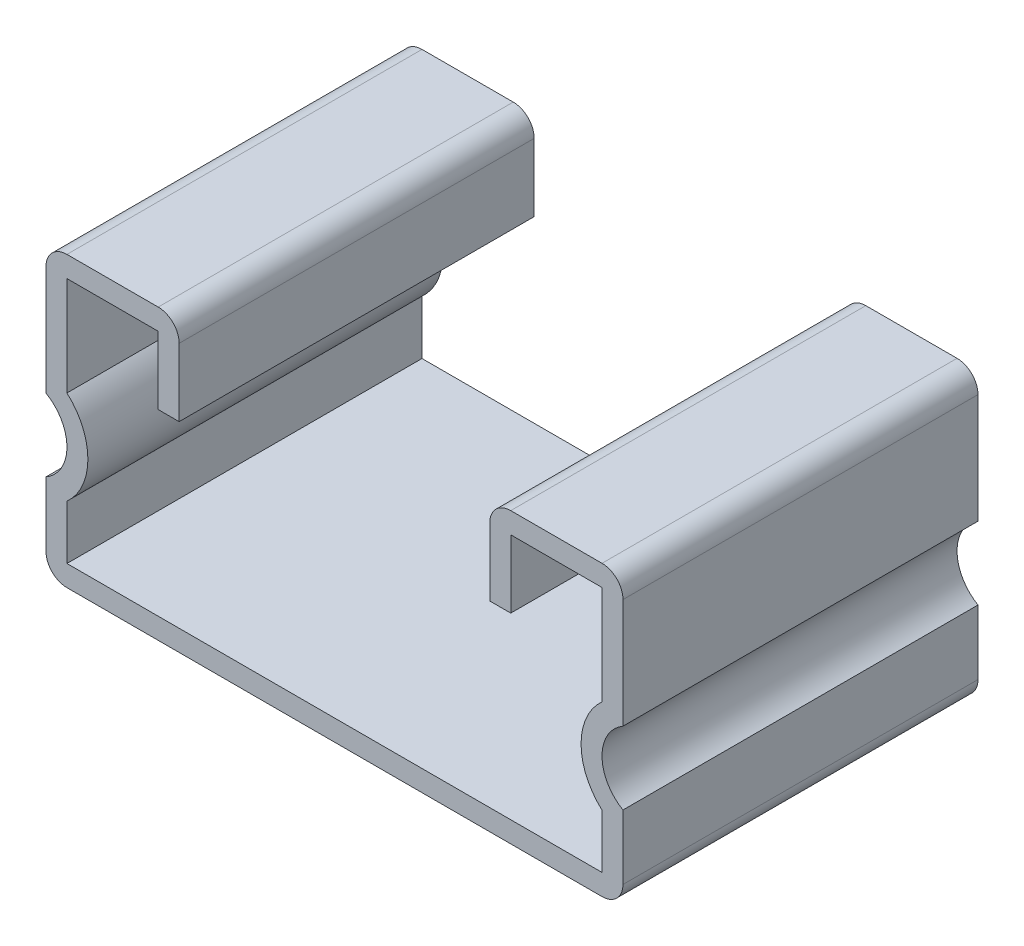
ISO-10303-21;
HEADER;
FILE_DESCRIPTION(('STEP AP214'),'2;1');
FILE_NAME('part.step','',(''),(''),'','','');
FILE_SCHEMA(('AUTOMOTIVE_DESIGN { 1 0 10303 214 1 1 1 1 }'));
ENDSEC;
DATA;
#1=APPLICATION_CONTEXT('core data for automotive mechanical design processes');
#2=APPLICATION_PROTOCOL_DEFINITION('international standard','automotive_design',2000,#1);
#3=PRODUCT_CONTEXT('',#1,'mechanical');
#4=PRODUCT('Part','Part','',(#3));
#5=PRODUCT_RELATED_PRODUCT_CATEGORY('part','',(#4));
#6=PRODUCT_DEFINITION_FORMATION('','',#4);
#7=PRODUCT_DEFINITION_CONTEXT('part definition',#1,'design');
#8=PRODUCT_DEFINITION('design','',#6,#7);
#9=PRODUCT_DEFINITION_SHAPE('','',#8);
#10=(LENGTH_UNIT() NAMED_UNIT(*) SI_UNIT(.MILLI.,.METRE.));
#11=(NAMED_UNIT(*) PLANE_ANGLE_UNIT() SI_UNIT($,.RADIAN.));
#12=(NAMED_UNIT(*) SI_UNIT($,.STERADIAN.) SOLID_ANGLE_UNIT());
#13=UNCERTAINTY_MEASURE_WITH_UNIT(LENGTH_MEASURE(1.E-05),#10,'distance_accuracy_value','');
#14=(GEOMETRIC_REPRESENTATION_CONTEXT(3) GLOBAL_UNCERTAINTY_ASSIGNED_CONTEXT((#13)) GLOBAL_UNIT_ASSIGNED_CONTEXT((#10,
#11,#12)) REPRESENTATION_CONTEXT('',''));
#15=CARTESIAN_POINT('',(0.,0.,0.));
#16=DIRECTION('',(0.,0.,1.));
#17=DIRECTION('',(1.,0.,0.));
#18=AXIS2_PLACEMENT_3D('',#15,#16,#17);
#19=CARTESIAN_POINT('',(-19.1389,10.4394,12.7));
#20=DIRECTION('',(-1.,0.,0.));
#21=DIRECTION('',(0.,0.,1.));
#22=AXIS2_PLACEMENT_3D('',#19,#20,#21);
#23=PLANE('',#22);
#24=DIRECTION('',(0.,1.,0.));
#25=VECTOR('',#24,1.);
#26=CARTESIAN_POINT('',(-19.1389,10.4394,-12.7));
#27=LINE('',#26,#25);
#28=CARTESIAN_POINT('',(-19.1389,3.35097147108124,-12.7));
#29=VERTEX_POINT('',#28);
#30=CARTESIAN_POINT('',(-19.1389,10.4394,-12.7));
#31=VERTEX_POINT('',#30);
#32=EDGE_CURVE('E261',#29,#31,#27,.T.);
#33=ORIENTED_EDGE('',*,*,#32,.T.);
#34=DIRECTION('',(0.,0.,-1.));
#35=VECTOR('',#34,1.);
#36=CARTESIAN_POINT('',(-19.1389,10.4394,12.7));
#37=LINE('',#36,#35);
#38=CARTESIAN_POINT('',(-19.1389,10.4394,12.7));
#39=VERTEX_POINT('',#38);
#40=EDGE_CURVE('E11',#39,#31,#37,.T.);
#41=ORIENTED_EDGE('',*,*,#40,.F.);
#42=DIRECTION('',(0.,1.,0.));
#43=VECTOR('',#42,1.);
#44=CARTESIAN_POINT('',(-19.1389,10.4394,12.7));
#45=LINE('',#44,#43);
#46=CARTESIAN_POINT('',(-19.1389,3.35097147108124,12.7));
#47=VERTEX_POINT('',#46);
#48=EDGE_CURVE('E319',#47,#39,#45,.T.);
#49=ORIENTED_EDGE('',*,*,#48,.F.);
#50=DIRECTION('',(0.,0.,-1.));
#51=VECTOR('',#50,1.);
#52=CARTESIAN_POINT('',(-19.1389,3.35097147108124,12.7));
#53=LINE('',#52,#51);
#54=EDGE_CURVE('E257',#47,#29,#53,.T.);
#55=ORIENTED_EDGE('',*,*,#54,.T.);
#56=EDGE_LOOP('',(#33,#41,#49,#55));
#57=FACE_BOUND('',#56,.T.);
#58=ADVANCED_FACE('F33',(#57),#23,.F.);
#59=CARTESIAN_POINT('',(-19.1389,10.4394,12.7));
#60=DIRECTION('',(0.,1.,0.));
#61=DIRECTION('',(-1.,0.,0.));
#62=AXIS2_PLACEMENT_3D('',#59,#60,#61);
#63=PLANE('',#62);
#64=DIRECTION('',(1.,0.,0.));
#65=VECTOR('',#64,1.);
#66=CARTESIAN_POINT('',(-19.1389,10.4394,-12.7));
#67=LINE('',#66,#65);
#68=CARTESIAN_POINT('',(-12.6111,10.4394,-12.7));
#69=VERTEX_POINT('',#68);
#70=EDGE_CURVE('E264',#31,#69,#67,.T.);
#71=ORIENTED_EDGE('',*,*,#70,.T.);
#72=DIRECTION('',(0.,0.,-1.));
#73=VECTOR('',#72,1.);
#74=CARTESIAN_POINT('',(-12.6111,10.4394,12.7));
#75=LINE('',#74,#73);
#76=CARTESIAN_POINT('',(-12.6111,10.4394,12.7));
#77=VERTEX_POINT('',#76);
#78=EDGE_CURVE('E41',#77,#69,#75,.T.);
#79=ORIENTED_EDGE('',*,*,#78,.F.);
#80=DIRECTION('',(1.,0.,0.));
#81=VECTOR('',#80,1.);
#82=CARTESIAN_POINT('',(-19.1389,10.4394,12.7));
#83=LINE('',#82,#81);
#84=EDGE_CURVE('E158',#39,#77,#83,.T.);
#85=ORIENTED_EDGE('',*,*,#84,.F.);
#86=ORIENTED_EDGE('',*,*,#40,.T.);
#87=EDGE_LOOP('',(#71,#79,#85,#86));
#88=FACE_BOUND('',#87,.T.);
#89=ADVANCED_FACE('F487',(#88),#63,.F.);
#90=CARTESIAN_POINT('',(-12.6111,10.4394,12.7));
#91=DIRECTION('',(1.,0.,0.));
#92=DIRECTION('',(0.,0.,-1.));
#93=AXIS2_PLACEMENT_3D('',#90,#91,#92);
#94=PLANE('',#93);
#95=DIRECTION('',(0.,-1.,0.));
#96=VECTOR('',#95,1.);
#97=CARTESIAN_POINT('',(-12.6111,10.4394,-12.7));
#98=LINE('',#97,#96);
#99=CARTESIAN_POINT('',(-12.6111,5.588,-12.7));
#100=VERTEX_POINT('',#99);
#101=EDGE_CURVE('E266',#69,#100,#98,.T.);
#102=ORIENTED_EDGE('',*,*,#101,.T.);
#103=DIRECTION('',(0.,0.,-1.));
#104=VECTOR('',#103,1.);
#105=CARTESIAN_POINT('',(-12.6111,5.588,12.7));
#106=LINE('',#105,#104);
#107=CARTESIAN_POINT('',(-12.6111,5.588,12.7));
#108=VERTEX_POINT('',#107);
#109=EDGE_CURVE('E392',#108,#100,#106,.T.);
#110=ORIENTED_EDGE('',*,*,#109,.F.);
#111=DIRECTION('',(0.,-1.,0.));
#112=VECTOR('',#111,1.);
#113=CARTESIAN_POINT('',(-12.6111,10.4394,12.7));
#114=LINE('',#113,#112);
#115=EDGE_CURVE('E400',#77,#108,#114,.T.);
#116=ORIENTED_EDGE('',*,*,#115,.F.);
#117=ORIENTED_EDGE('',*,*,#78,.T.);
#118=EDGE_LOOP('',(#102,#110,#116,#117));
#119=FACE_BOUND('',#118,.T.);
#120=ADVANCED_FACE('F398',(#119),#94,.F.);
#121=CARTESIAN_POINT('',(-12.6111,5.588,12.7));
#122=DIRECTION('',(0.,1.,0.));
#123=DIRECTION('',(0.,0.,1.));
#124=AXIS2_PLACEMENT_3D('',#121,#122,#123);
#125=PLANE('',#124);
#126=DIRECTION('',(1.,0.,0.));
#127=VECTOR('',#126,1.);
#128=CARTESIAN_POINT('',(-12.6111,5.588,-12.7));
#129=LINE('',#128,#127);
#130=CARTESIAN_POINT('',(-11.1125,5.588,-12.7));
#131=VERTEX_POINT('',#130);
#132=EDGE_CURVE('E268',#100,#131,#129,.T.);
#133=ORIENTED_EDGE('',*,*,#132,.T.);
#134=DIRECTION('',(0.,0.,-1.));
#135=VECTOR('',#134,1.);
#136=CARTESIAN_POINT('',(-11.1125,5.588,12.7));
#137=LINE('',#136,#135);
#138=CARTESIAN_POINT('',(-11.1125,5.588,12.7));
#139=VERTEX_POINT('',#138);
#140=EDGE_CURVE('E389',#139,#131,#137,.T.);
#141=ORIENTED_EDGE('',*,*,#140,.F.);
#142=DIRECTION('',(1.,0.,0.));
#143=VECTOR('',#142,1.);
#144=CARTESIAN_POINT('',(-12.6111,5.588,12.7));
#145=LINE('',#144,#143);
#146=EDGE_CURVE('E418',#108,#139,#145,.T.);
#147=ORIENTED_EDGE('',*,*,#146,.F.);
#148=ORIENTED_EDGE('',*,*,#109,.T.);
#149=EDGE_LOOP('',(#133,#141,#147,#148));
#150=FACE_BOUND('',#149,.T.);
#151=ADVANCED_FACE('F409',(#150),#125,.F.);
#152=CARTESIAN_POINT('',(-11.1125,10.4394,12.7));
#153=DIRECTION('',(-1.,0.,0.));
#154=DIRECTION('',(0.,-1.,0.));
#155=AXIS2_PLACEMENT_3D('',#152,#153,#154);
#156=PLANE('',#155);
#157=DIRECTION('',(0.,1.,0.));
#158=VECTOR('',#157,1.);
#159=CARTESIAN_POINT('',(-11.1125,10.4394,-12.7));
#160=LINE('',#159,#158);
#161=CARTESIAN_POINT('',(-11.1125,10.4394,-12.7));
#162=VERTEX_POINT('',#161);
#163=EDGE_CURVE('E270',#131,#162,#160,.T.);
#164=ORIENTED_EDGE('',*,*,#163,.T.);
#165=DIRECTION('',(0.,0.,-1.));
#166=VECTOR('',#165,1.);
#167=CARTESIAN_POINT('',(-11.1125,10.4394,12.7));
#168=LINE('',#167,#166);
#169=CARTESIAN_POINT('',(-11.1125,10.4394,12.7));
#170=VERTEX_POINT('',#169);
#171=EDGE_CURVE('E386',#170,#162,#168,.T.);
#172=ORIENTED_EDGE('',*,*,#171,.F.);
#173=DIRECTION('',(0.,1.,0.));
#174=VECTOR('',#173,1.);
#175=CARTESIAN_POINT('',(-11.1125,10.4394,12.7));
#176=LINE('',#175,#174);
#177=EDGE_CURVE('E415',#139,#170,#176,.T.);
#178=ORIENTED_EDGE('',*,*,#177,.F.);
#179=ORIENTED_EDGE('',*,*,#140,.T.);
#180=EDGE_LOOP('',(#164,#172,#178,#179));
#181=FACE_BOUND('',#180,.T.);
#182=ADVANCED_FACE('F413',(#181),#156,.F.);
#183=CARTESIAN_POINT('',(-12.6111,10.4394,12.7));
#184=DIRECTION('',(0.,0.,-1.));
#185=DIRECTION('',(-1.,0.,0.));
#186=AXIS2_PLACEMENT_3D('',#183,#184,#185);
#187=CYLINDRICAL_SURFACE('',#186,1.4986);
#188=CARTESIAN_POINT('',(-12.6111,10.4394,-12.7));
#189=DIRECTION('',(0.,0.,1.));
#190=DIRECTION('',(-1.,0.,0.));
#191=AXIS2_PLACEMENT_3D('',#188,#189,#190);
#192=CIRCLE('',#191,1.4986);
#193=CARTESIAN_POINT('',(-12.6111,11.938,-12.7));
#194=VERTEX_POINT('',#193);
#195=EDGE_CURVE('E272',#162,#194,#192,.T.);
#196=ORIENTED_EDGE('',*,*,#195,.T.);
#197=DIRECTION('',(0.,0.,-1.));
#198=VECTOR('',#197,1.);
#199=CARTESIAN_POINT('',(-12.6111,11.938,12.7));
#200=LINE('',#199,#198);
#201=CARTESIAN_POINT('',(-12.6111,11.938,12.7));
#202=VERTEX_POINT('',#201);
#203=EDGE_CURVE('E383',#202,#194,#200,.T.);
#204=ORIENTED_EDGE('',*,*,#203,.F.);
#205=CARTESIAN_POINT('',(-12.6111,10.4394,12.7));
#206=DIRECTION('',(0.,0.,1.));
#207=DIRECTION('',(-1.,0.,0.));
#208=AXIS2_PLACEMENT_3D('',#205,#206,#207);
#209=CIRCLE('',#208,1.4986);
#210=EDGE_CURVE('E417',#170,#202,#209,.T.);
#211=ORIENTED_EDGE('',*,*,#210,.F.);
#212=ORIENTED_EDGE('',*,*,#171,.T.);
#213=EDGE_LOOP('',(#196,#204,#211,#212));
#214=FACE_BOUND('',#213,.T.);
#215=ADVANCED_FACE('F500',(#214),#187,.T.);
#216=CARTESIAN_POINT('',(-19.1389,11.938,12.7));
#217=DIRECTION('',(0.,-1.,0.));
#218=DIRECTION('',(0.,0.,-1.));
#219=AXIS2_PLACEMENT_3D('',#216,#217,#218);
#220=PLANE('',#219);
#221=DIRECTION('',(-1.,0.,0.));
#222=VECTOR('',#221,1.);
#223=CARTESIAN_POINT('',(-19.1389,11.938,-12.7));
#224=LINE('',#223,#222);
#225=CARTESIAN_POINT('',(-19.1389,11.938,-12.7));
#226=VERTEX_POINT('',#225);
#227=EDGE_CURVE('E274',#194,#226,#224,.T.);
#228=ORIENTED_EDGE('',*,*,#227,.T.);
#229=DIRECTION('',(0.,0.,-1.));
#230=VECTOR('',#229,1.);
#231=CARTESIAN_POINT('',(-19.1389,11.938,12.7));
#232=LINE('',#231,#230);
#233=CARTESIAN_POINT('',(-19.1389,11.938,12.7));
#234=VERTEX_POINT('',#233);
#235=EDGE_CURVE('E380',#234,#226,#232,.T.);
#236=ORIENTED_EDGE('',*,*,#235,.F.);
#237=DIRECTION('',(-1.,0.,0.));
#238=VECTOR('',#237,1.);
#239=CARTESIAN_POINT('',(-19.1389,11.938,12.7));
#240=LINE('',#239,#238);
#241=EDGE_CURVE('E420',#202,#234,#240,.T.);
#242=ORIENTED_EDGE('',*,*,#241,.F.);
#243=ORIENTED_EDGE('',*,*,#203,.T.);
#244=EDGE_LOOP('',(#228,#236,#242,#243));
#245=FACE_BOUND('',#244,.T.);
#246=ADVANCED_FACE('F503',(#245),#220,.F.);
#247=CARTESIAN_POINT('',(-19.1389,10.4394,12.7));
#248=DIRECTION('',(0.,0.,-1.));
#249=DIRECTION('',(-1.,0.,0.));
#250=AXIS2_PLACEMENT_3D('',#247,#248,#249);
#251=CYLINDRICAL_SURFACE('',#250,1.49860000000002);
#252=CARTESIAN_POINT('',(-19.1389,10.4394,-12.7));
#253=DIRECTION('',(0.,0.,1.));
#254=DIRECTION('',(-1.,0.,0.));
#255=AXIS2_PLACEMENT_3D('',#252,#253,#254);
#256=CIRCLE('',#255,1.49860000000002);
#257=CARTESIAN_POINT('',(-20.6375,10.4394,-12.7));
#258=VERTEX_POINT('',#257);
#259=EDGE_CURVE('E276',#226,#258,#256,.T.);
#260=ORIENTED_EDGE('',*,*,#259,.T.);
#261=DIRECTION('',(0.,0.,-1.));
#262=VECTOR('',#261,1.);
#263=CARTESIAN_POINT('',(-20.6375,10.4394,12.7));
#264=LINE('',#263,#262);
#265=CARTESIAN_POINT('',(-20.6375,10.4394,12.7));
#266=VERTEX_POINT('',#265);
#267=EDGE_CURVE('E377',#266,#258,#264,.T.);
#268=ORIENTED_EDGE('',*,*,#267,.F.);
#269=CARTESIAN_POINT('',(-19.1389,10.4394,12.7));
#270=DIRECTION('',(0.,0.,1.));
#271=DIRECTION('',(-1.,0.,0.));
#272=AXIS2_PLACEMENT_3D('',#269,#270,#271);
#273=CIRCLE('',#272,1.49860000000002);
#274=EDGE_CURVE('E426',#234,#266,#273,.T.);
#275=ORIENTED_EDGE('',*,*,#274,.F.);
#276=ORIENTED_EDGE('',*,*,#235,.T.);
#277=EDGE_LOOP('',(#260,#268,#275,#276));
#278=FACE_BOUND('',#277,.T.);
#279=ADVANCED_FACE('F507',(#278),#251,.T.);
#280=CARTESIAN_POINT('',(-20.6375,10.4394,12.7));
#281=DIRECTION('',(1.,0.,0.));
#282=DIRECTION('',(0.,1.,0.));
#283=AXIS2_PLACEMENT_3D('',#280,#281,#282);
#284=PLANE('',#283);
#285=DIRECTION('',(0.,-1.,0.));
#286=VECTOR('',#285,1.);
#287=CARTESIAN_POINT('',(-20.6375,10.4394,-12.7));
#288=LINE('',#287,#286);
#289=CARTESIAN_POINT('',(-20.6375,2.59565134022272,-12.7));
#290=VERTEX_POINT('',#289);
#291=EDGE_CURVE('E278',#258,#290,#288,.T.);
#292=ORIENTED_EDGE('',*,*,#291,.T.);
#293=DIRECTION('',(0.,0.,-1.));
#294=VECTOR('',#293,1.);
#295=CARTESIAN_POINT('',(-20.6375,2.59565134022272,12.7));
#296=LINE('',#295,#294);
#297=CARTESIAN_POINT('',(-20.6375,2.59565134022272,12.7));
#298=VERTEX_POINT('',#297);
#299=EDGE_CURVE('E374',#298,#290,#296,.T.);
#300=ORIENTED_EDGE('',*,*,#299,.F.);
#301=DIRECTION('',(0.,-1.,0.));
#302=VECTOR('',#301,1.);
#303=CARTESIAN_POINT('',(-20.6375,10.4394,12.7));
#304=LINE('',#303,#302);
#305=EDGE_CURVE('E428',#266,#298,#304,.T.);
#306=ORIENTED_EDGE('',*,*,#305,.F.);
#307=ORIENTED_EDGE('',*,*,#267,.T.);
#308=EDGE_LOOP('',(#292,#300,#306,#307));
#309=FACE_BOUND('',#308,.T.);
#310=ADVANCED_FACE('F511',(#309),#284,.F.);
#311=CARTESIAN_POINT('',(-22.1361,0.,12.7));
#312=DIRECTION('',(0.,0.,-1.));
#313=DIRECTION('',(-1.,0.,0.));
#314=AXIS2_PLACEMENT_3D('',#311,#312,#313);
#315=CYLINDRICAL_SURFACE('',#314,2.9972);
#316=CARTESIAN_POINT('',(-22.1361,0.,-12.7));
#317=DIRECTION('',(0.,0.,-1.));
#318=DIRECTION('',(1.,0.,0.));
#319=AXIS2_PLACEMENT_3D('',#316,#317,#318);
#320=CIRCLE('',#319,2.9972);
#321=CARTESIAN_POINT('',(-20.6375,-2.59565134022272,-12.7));
#322=VERTEX_POINT('',#321);
#323=EDGE_CURVE('E280',#290,#322,#320,.T.);
#324=ORIENTED_EDGE('',*,*,#323,.T.);
#325=DIRECTION('',(0.,0.,-1.));
#326=VECTOR('',#325,1.);
#327=CARTESIAN_POINT('',(-20.6375,-2.59565134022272,12.7));
#328=LINE('',#327,#326);
#329=CARTESIAN_POINT('',(-20.6375,-2.59565134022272,12.7));
#330=VERTEX_POINT('',#329);
#331=EDGE_CURVE('E371',#330,#322,#328,.T.);
#332=ORIENTED_EDGE('',*,*,#331,.F.);
#333=CARTESIAN_POINT('',(-22.1361,0.,12.7));
#334=DIRECTION('',(0.,0.,-1.));
#335=DIRECTION('',(1.,0.,0.));
#336=AXIS2_PLACEMENT_3D('',#333,#334,#335);
#337=CIRCLE('',#336,2.9972);
#338=EDGE_CURVE('E430',#298,#330,#337,.T.);
#339=ORIENTED_EDGE('',*,*,#338,.F.);
#340=ORIENTED_EDGE('',*,*,#299,.T.);
#341=EDGE_LOOP('',(#324,#332,#339,#340));
#342=FACE_BOUND('',#341,.T.);
#343=ADVANCED_FACE('F515',(#342),#315,.F.);
#344=CARTESIAN_POINT('',(-20.6375,-2.59565134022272,12.7));
#345=DIRECTION('',(1.,0.,0.));
#346=DIRECTION('',(0.,1.,0.));
#347=AXIS2_PLACEMENT_3D('',#344,#345,#346);
#348=PLANE('',#347);
#349=DIRECTION('',(0.,-1.,0.));
#350=VECTOR('',#349,1.);
#351=CARTESIAN_POINT('',(-20.6375,-2.59565134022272,-12.7));
#352=LINE('',#351,#350);
#353=CARTESIAN_POINT('',(-20.6375,-7.2136,-12.7));
#354=VERTEX_POINT('',#353);
#355=EDGE_CURVE('E282',#322,#354,#352,.T.);
#356=ORIENTED_EDGE('',*,*,#355,.T.);
#357=DIRECTION('',(0.,0.,-1.));
#358=VECTOR('',#357,1.);
#359=CARTESIAN_POINT('',(-20.6375,-7.2136,12.7));
#360=LINE('',#359,#358);
#361=CARTESIAN_POINT('',(-20.6375,-7.2136,12.7));
#362=VERTEX_POINT('',#361);
#363=EDGE_CURVE('E368',#362,#354,#360,.T.);
#364=ORIENTED_EDGE('',*,*,#363,.F.);
#365=DIRECTION('',(0.,-1.,0.));
#366=VECTOR('',#365,1.);
#367=CARTESIAN_POINT('',(-20.6375,-2.59565134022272,12.7));
#368=LINE('',#367,#366);
#369=EDGE_CURVE('E432',#330,#362,#368,.T.);
#370=ORIENTED_EDGE('',*,*,#369,.F.);
#371=ORIENTED_EDGE('',*,*,#331,.T.);
#372=EDGE_LOOP('',(#356,#364,#370,#371));
#373=FACE_BOUND('',#372,.T.);
#374=ADVANCED_FACE('F519',(#373),#348,.F.);
#375=CARTESIAN_POINT('',(-19.1389,-7.2136,12.7));
#376=DIRECTION('',(0.,0.,-1.));
#377=DIRECTION('',(-1.,0.,0.));
#378=AXIS2_PLACEMENT_3D('',#375,#376,#377);
#379=CYLINDRICAL_SURFACE('',#378,1.4986);
#380=CARTESIAN_POINT('',(-19.1389,-7.2136,-12.7));
#381=DIRECTION('',(0.,0.,1.));
#382=DIRECTION('',(-1.,0.,0.));
#383=AXIS2_PLACEMENT_3D('',#380,#381,#382);
#384=CIRCLE('',#383,1.4986);
#385=CARTESIAN_POINT('',(-19.1389,-8.7122,-12.7));
#386=VERTEX_POINT('',#385);
#387=EDGE_CURVE('E284',#354,#386,#384,.T.);
#388=ORIENTED_EDGE('',*,*,#387,.T.);
#389=DIRECTION('',(0.,0.,-1.));
#390=VECTOR('',#389,1.);
#391=CARTESIAN_POINT('',(-19.1389,-8.7122,12.7));
#392=LINE('',#391,#390);
#393=CARTESIAN_POINT('',(-19.1389,-8.7122,12.7));
#394=VERTEX_POINT('',#393);
#395=EDGE_CURVE('E365',#394,#386,#392,.T.);
#396=ORIENTED_EDGE('',*,*,#395,.F.);
#397=CARTESIAN_POINT('',(-19.1389,-7.2136,12.7));
#398=DIRECTION('',(0.,0.,1.));
#399=DIRECTION('',(-1.,0.,0.));
#400=AXIS2_PLACEMENT_3D('',#397,#398,#399);
#401=CIRCLE('',#400,1.4986);
#402=EDGE_CURVE('E434',#362,#394,#401,.T.);
#403=ORIENTED_EDGE('',*,*,#402,.F.);
#404=ORIENTED_EDGE('',*,*,#363,.T.);
#405=EDGE_LOOP('',(#388,#396,#403,#404));
#406=FACE_BOUND('',#405,.T.);
#407=ADVANCED_FACE('F523',(#406),#379,.T.);
#408=CARTESIAN_POINT('',(-19.1389,-8.7122,12.7));
#409=DIRECTION('',(0.,1.,0.));
#410=DIRECTION('',(0.,0.,1.));
#411=AXIS2_PLACEMENT_3D('',#408,#409,#410);
#412=PLANE('',#411);
#413=DIRECTION('',(1.,0.,0.));
#414=VECTOR('',#413,1.);
#415=CARTESIAN_POINT('',(-19.1389,-8.7122,-12.7));
#416=LINE('',#415,#414);
#417=CARTESIAN_POINT('',(19.1389,-8.7122,-12.7));
#418=VERTEX_POINT('',#417);
#419=EDGE_CURVE('E286',#386,#418,#416,.T.);
#420=ORIENTED_EDGE('',*,*,#419,.T.);
#421=DIRECTION('',(0.,0.,-1.));
#422=VECTOR('',#421,1.);
#423=CARTESIAN_POINT('',(19.1389,-8.7122,12.7));
#424=LINE('',#423,#422);
#425=CARTESIAN_POINT('',(19.1389,-8.7122,12.7));
#426=VERTEX_POINT('',#425);
#427=EDGE_CURVE('E362',#426,#418,#424,.T.);
#428=ORIENTED_EDGE('',*,*,#427,.F.);
#429=DIRECTION('',(1.,0.,0.));
#430=VECTOR('',#429,1.);
#431=CARTESIAN_POINT('',(-19.1389,-8.7122,12.7));
#432=LINE('',#431,#430);
#433=EDGE_CURVE('E436',#394,#426,#432,.T.);
#434=ORIENTED_EDGE('',*,*,#433,.F.);
#435=ORIENTED_EDGE('',*,*,#395,.T.);
#436=EDGE_LOOP('',(#420,#428,#434,#435));
#437=FACE_BOUND('',#436,.T.);
#438=ADVANCED_FACE('F527',(#437),#412,.F.);
#439=CARTESIAN_POINT('',(19.1389,-7.2136,12.7));
#440=DIRECTION('',(0.,0.,-1.));
#441=DIRECTION('',(-1.,0.,0.));
#442=AXIS2_PLACEMENT_3D('',#439,#440,#441);
#443=CYLINDRICAL_SURFACE('',#442,1.4986);
#444=CARTESIAN_POINT('',(19.1389,-7.2136,-12.7));
#445=DIRECTION('',(0.,0.,1.));
#446=DIRECTION('',(-1.,0.,0.));
#447=AXIS2_PLACEMENT_3D('',#444,#445,#446);
#448=CIRCLE('',#447,1.4986);
#449=CARTESIAN_POINT('',(20.6375,-7.2136,-12.7));
#450=VERTEX_POINT('',#449);
#451=EDGE_CURVE('E288',#418,#450,#448,.T.);
#452=ORIENTED_EDGE('',*,*,#451,.T.);
#453=DIRECTION('',(0.,0.,-1.));
#454=VECTOR('',#453,1.);
#455=CARTESIAN_POINT('',(20.6375,-7.2136,12.7));
#456=LINE('',#455,#454);
#457=CARTESIAN_POINT('',(20.6375,-7.2136,12.7));
#458=VERTEX_POINT('',#457);
#459=EDGE_CURVE('E359',#458,#450,#456,.T.);
#460=ORIENTED_EDGE('',*,*,#459,.F.);
#461=CARTESIAN_POINT('',(19.1389,-7.2136,12.7));
#462=DIRECTION('',(0.,0.,1.));
#463=DIRECTION('',(-1.,0.,0.));
#464=AXIS2_PLACEMENT_3D('',#461,#462,#463);
#465=CIRCLE('',#464,1.4986);
#466=EDGE_CURVE('E438',#426,#458,#465,.T.);
#467=ORIENTED_EDGE('',*,*,#466,.F.);
#468=ORIENTED_EDGE('',*,*,#427,.T.);
#469=EDGE_LOOP('',(#452,#460,#467,#468));
#470=FACE_BOUND('',#469,.T.);
#471=ADVANCED_FACE('F531',(#470),#443,.T.);
#472=CARTESIAN_POINT('',(20.6375,-7.2136,12.7));
#473=DIRECTION('',(-1.,0.,0.));
#474=DIRECTION('',(0.,0.,1.));
#475=AXIS2_PLACEMENT_3D('',#472,#473,#474);
#476=PLANE('',#475);
#477=DIRECTION('',(0.,1.,0.));
#478=VECTOR('',#477,1.);
#479=CARTESIAN_POINT('',(20.6375,-7.2136,-12.7));
#480=LINE('',#479,#478);
#481=CARTESIAN_POINT('',(20.6375,-2.59565134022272,-12.7));
#482=VERTEX_POINT('',#481);
#483=EDGE_CURVE('E290',#450,#482,#480,.T.);
#484=ORIENTED_EDGE('',*,*,#483,.T.);
#485=DIRECTION('',(0.,0.,-1.));
#486=VECTOR('',#485,1.);
#487=CARTESIAN_POINT('',(20.6375,-2.59565134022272,12.7));
#488=LINE('',#487,#486);
#489=CARTESIAN_POINT('',(20.6375,-2.59565134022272,12.7));
#490=VERTEX_POINT('',#489);
#491=EDGE_CURVE('E356',#490,#482,#488,.T.);
#492=ORIENTED_EDGE('',*,*,#491,.F.);
#493=DIRECTION('',(0.,1.,0.));
#494=VECTOR('',#493,1.);
#495=CARTESIAN_POINT('',(20.6375,-7.2136,12.7));
#496=LINE('',#495,#494);
#497=EDGE_CURVE('E440',#458,#490,#496,.T.);
#498=ORIENTED_EDGE('',*,*,#497,.F.);
#499=ORIENTED_EDGE('',*,*,#459,.T.);
#500=EDGE_LOOP('',(#484,#492,#498,#499));
#501=FACE_BOUND('',#500,.T.);
#502=ADVANCED_FACE('F535',(#501),#476,.F.);
#503=CARTESIAN_POINT('',(22.1361,0.,12.7));
#504=DIRECTION('',(0.,0.,-1.));
#505=DIRECTION('',(-1.,0.,0.));
#506=AXIS2_PLACEMENT_3D('',#503,#504,#505);
#507=CYLINDRICAL_SURFACE('',#506,2.9972);
#508=CARTESIAN_POINT('',(22.1361,0.,-12.7));
#509=DIRECTION('',(0.,0.,-1.));
#510=DIRECTION('',(1.,0.,0.));
#511=AXIS2_PLACEMENT_3D('',#508,#509,#510);
#512=CIRCLE('',#511,2.9972);
#513=CARTESIAN_POINT('',(20.6375,2.59565134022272,-12.7));
#514=VERTEX_POINT('',#513);
#515=EDGE_CURVE('E292',#482,#514,#512,.T.);
#516=ORIENTED_EDGE('',*,*,#515,.T.);
#517=DIRECTION('',(0.,0.,-1.));
#518=VECTOR('',#517,1.);
#519=CARTESIAN_POINT('',(20.6375,2.59565134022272,12.7));
#520=LINE('',#519,#518);
#521=CARTESIAN_POINT('',(20.6375,2.59565134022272,12.7));
#522=VERTEX_POINT('',#521);
#523=EDGE_CURVE('E353',#522,#514,#520,.T.);
#524=ORIENTED_EDGE('',*,*,#523,.F.);
#525=CARTESIAN_POINT('',(22.1361,0.,12.7));
#526=DIRECTION('',(0.,0.,-1.));
#527=DIRECTION('',(1.,0.,0.));
#528=AXIS2_PLACEMENT_3D('',#525,#526,#527);
#529=CIRCLE('',#528,2.9972);
#530=EDGE_CURVE('E442',#490,#522,#529,.T.);
#531=ORIENTED_EDGE('',*,*,#530,.F.);
#532=ORIENTED_EDGE('',*,*,#491,.T.);
#533=EDGE_LOOP('',(#516,#524,#531,#532));
#534=FACE_BOUND('',#533,.T.);
#535=ADVANCED_FACE('F539',(#534),#507,.F.);
#536=CARTESIAN_POINT('',(20.6375,2.59565134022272,12.7));
#537=DIRECTION('',(-1.,0.,0.));
#538=DIRECTION('',(0.,-1.,0.));
#539=AXIS2_PLACEMENT_3D('',#536,#537,#538);
#540=PLANE('',#539);
#541=DIRECTION('',(0.,1.,0.));
#542=VECTOR('',#541,1.);
#543=CARTESIAN_POINT('',(20.6375,2.59565134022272,-12.7));
#544=LINE('',#543,#542);
#545=CARTESIAN_POINT('',(20.6375,10.4394,-12.7));
#546=VERTEX_POINT('',#545);
#547=EDGE_CURVE('E294',#514,#546,#544,.T.);
#548=ORIENTED_EDGE('',*,*,#547,.T.);
#549=DIRECTION('',(0.,0.,-1.));
#550=VECTOR('',#549,1.);
#551=CARTESIAN_POINT('',(20.6375,10.4394,12.7));
#552=LINE('',#551,#550);
#553=CARTESIAN_POINT('',(20.6375,10.4394,12.7));
#554=VERTEX_POINT('',#553);
#555=EDGE_CURVE('E350',#554,#546,#552,.T.);
#556=ORIENTED_EDGE('',*,*,#555,.F.);
#557=DIRECTION('',(0.,1.,0.));
#558=VECTOR('',#557,1.);
#559=CARTESIAN_POINT('',(20.6375,2.59565134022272,12.7));
#560=LINE('',#559,#558);
#561=EDGE_CURVE('E444',#522,#554,#560,.T.);
#562=ORIENTED_EDGE('',*,*,#561,.F.);
#563=ORIENTED_EDGE('',*,*,#523,.T.);
#564=EDGE_LOOP('',(#548,#556,#562,#563));
#565=FACE_BOUND('',#564,.T.);
#566=ADVANCED_FACE('F543',(#565),#540,.F.);
#567=CARTESIAN_POINT('',(19.1389,10.4394,12.7));
#568=DIRECTION('',(0.,0.,-1.));
#569=DIRECTION('',(-1.,0.,0.));
#570=AXIS2_PLACEMENT_3D('',#567,#568,#569);
#571=CYLINDRICAL_SURFACE('',#570,1.4986);
#572=CARTESIAN_POINT('',(19.1389,10.4394,-12.7));
#573=DIRECTION('',(0.,0.,1.));
#574=DIRECTION('',(-1.,0.,0.));
#575=AXIS2_PLACEMENT_3D('',#572,#573,#574);
#576=CIRCLE('',#575,1.4986);
#577=CARTESIAN_POINT('',(19.1389,11.938,-12.7));
#578=VERTEX_POINT('',#577);
#579=EDGE_CURVE('E296',#546,#578,#576,.T.);
#580=ORIENTED_EDGE('',*,*,#579,.T.);
#581=DIRECTION('',(0.,0.,-1.));
#582=VECTOR('',#581,1.);
#583=CARTESIAN_POINT('',(19.1389,11.938,12.7));
#584=LINE('',#583,#582);
#585=CARTESIAN_POINT('',(19.1389,11.938,12.7));
#586=VERTEX_POINT('',#585);
#587=EDGE_CURVE('E347',#586,#578,#584,.T.);
#588=ORIENTED_EDGE('',*,*,#587,.F.);
#589=CARTESIAN_POINT('',(19.1389,10.4394,12.7));
#590=DIRECTION('',(0.,0.,1.));
#591=DIRECTION('',(-1.,0.,0.));
#592=AXIS2_PLACEMENT_3D('',#589,#590,#591);
#593=CIRCLE('',#592,1.4986);
#594=EDGE_CURVE('E446',#554,#586,#593,.T.);
#595=ORIENTED_EDGE('',*,*,#594,.F.);
#596=ORIENTED_EDGE('',*,*,#555,.T.);
#597=EDGE_LOOP('',(#580,#588,#595,#596));
#598=FACE_BOUND('',#597,.T.);
#599=ADVANCED_FACE('F547',(#598),#571,.T.);
#600=CARTESIAN_POINT('',(19.1389,11.938,12.7));
#601=DIRECTION('',(0.,-1.,0.));
#602=DIRECTION('',(1.,0.,0.));
#603=AXIS2_PLACEMENT_3D('',#600,#601,#602);
#604=PLANE('',#603);
#605=DIRECTION('',(-1.,0.,0.));
#606=VECTOR('',#605,1.);
#607=CARTESIAN_POINT('',(19.1389,11.938,-12.7));
#608=LINE('',#607,#606);
#609=CARTESIAN_POINT('',(12.6111,11.938,-12.7));
#610=VERTEX_POINT('',#609);
#611=EDGE_CURVE('E298',#578,#610,#608,.T.);
#612=ORIENTED_EDGE('',*,*,#611,.T.);
#613=DIRECTION('',(0.,0.,-1.));
#614=VECTOR('',#613,1.);
#615=CARTESIAN_POINT('',(12.6111,11.938,12.7));
#616=LINE('',#615,#614);
#617=CARTESIAN_POINT('',(12.6111,11.938,12.7));
#618=VERTEX_POINT('',#617);
#619=EDGE_CURVE('E344',#618,#610,#616,.T.);
#620=ORIENTED_EDGE('',*,*,#619,.F.);
#621=DIRECTION('',(-1.,0.,0.));
#622=VECTOR('',#621,1.);
#623=CARTESIAN_POINT('',(19.1389,11.938,12.7));
#624=LINE('',#623,#622);
#625=EDGE_CURVE('E448',#586,#618,#624,.T.);
#626=ORIENTED_EDGE('',*,*,#625,.F.);
#627=ORIENTED_EDGE('',*,*,#587,.T.);
#628=EDGE_LOOP('',(#612,#620,#626,#627));
#629=FACE_BOUND('',#628,.T.);
#630=ADVANCED_FACE('F551',(#629),#604,.F.);
#631=CARTESIAN_POINT('',(12.6111,10.4394,12.7));
#632=DIRECTION('',(0.,0.,-1.));
#633=DIRECTION('',(-1.,0.,0.));
#634=AXIS2_PLACEMENT_3D('',#631,#632,#633);
#635=CYLINDRICAL_SURFACE('',#634,1.4986);
#636=CARTESIAN_POINT('',(12.6111,10.4394,-12.7));
#637=DIRECTION('',(0.,0.,1.));
#638=DIRECTION('',(-1.,0.,0.));
#639=AXIS2_PLACEMENT_3D('',#636,#637,#638);
#640=CIRCLE('',#639,1.4986);
#641=CARTESIAN_POINT('',(11.1125,10.4394,-12.7));
#642=VERTEX_POINT('',#641);
#643=EDGE_CURVE('E300',#610,#642,#640,.T.);
#644=ORIENTED_EDGE('',*,*,#643,.T.);
#645=DIRECTION('',(0.,0.,-1.));
#646=VECTOR('',#645,1.);
#647=CARTESIAN_POINT('',(11.1125,10.4394,12.7));
#648=LINE('',#647,#646);
#649=CARTESIAN_POINT('',(11.1125,10.4394,12.7));
#650=VERTEX_POINT('',#649);
#651=EDGE_CURVE('E341',#650,#642,#648,.T.);
#652=ORIENTED_EDGE('',*,*,#651,.F.);
#653=CARTESIAN_POINT('',(12.6111,10.4394,12.7));
#654=DIRECTION('',(0.,0.,1.));
#655=DIRECTION('',(-1.,0.,0.));
#656=AXIS2_PLACEMENT_3D('',#653,#654,#655);
#657=CIRCLE('',#656,1.4986);
#658=EDGE_CURVE('E450',#618,#650,#657,.T.);
#659=ORIENTED_EDGE('',*,*,#658,.F.);
#660=ORIENTED_EDGE('',*,*,#619,.T.);
#661=EDGE_LOOP('',(#644,#652,#659,#660));
#662=FACE_BOUND('',#661,.T.);
#663=ADVANCED_FACE('F555',(#662),#635,.T.);
#664=CARTESIAN_POINT('',(11.1125,10.4394,12.7));
#665=DIRECTION('',(1.,0.,0.));
#666=DIRECTION('',(0.,0.,-1.));
#667=AXIS2_PLACEMENT_3D('',#664,#665,#666);
#668=PLANE('',#667);
#669=DIRECTION('',(0.,-1.,0.));
#670=VECTOR('',#669,1.);
#671=CARTESIAN_POINT('',(11.1125,10.4394,-12.7));
#672=LINE('',#671,#670);
#673=CARTESIAN_POINT('',(11.1125,5.588,-12.7));
#674=VERTEX_POINT('',#673);
#675=EDGE_CURVE('E302',#642,#674,#672,.T.);
#676=ORIENTED_EDGE('',*,*,#675,.T.);
#677=DIRECTION('',(0.,0.,-1.));
#678=VECTOR('',#677,1.);
#679=CARTESIAN_POINT('',(11.1125,5.588,12.7));
#680=LINE('',#679,#678);
#681=CARTESIAN_POINT('',(11.1125,5.588,12.7));
#682=VERTEX_POINT('',#681);
#683=EDGE_CURVE('E338',#682,#674,#680,.T.);
#684=ORIENTED_EDGE('',*,*,#683,.F.);
#685=DIRECTION('',(0.,-1.,0.));
#686=VECTOR('',#685,1.);
#687=CARTESIAN_POINT('',(11.1125,10.4394,12.7));
#688=LINE('',#687,#686);
#689=EDGE_CURVE('E452',#650,#682,#688,.T.);
#690=ORIENTED_EDGE('',*,*,#689,.F.);
#691=ORIENTED_EDGE('',*,*,#651,.T.);
#692=EDGE_LOOP('',(#676,#684,#690,#691));
#693=FACE_BOUND('',#692,.T.);
#694=ADVANCED_FACE('F559',(#693),#668,.F.);
#695=CARTESIAN_POINT('',(11.1125,5.588,12.7));
#696=DIRECTION('',(0.,1.,0.));
#697=DIRECTION('',(-1.,0.,0.));
#698=AXIS2_PLACEMENT_3D('',#695,#696,#697);
#699=PLANE('',#698);
#700=DIRECTION('',(1.,0.,0.));
#701=VECTOR('',#700,1.);
#702=CARTESIAN_POINT('',(11.1125,5.588,-12.7));
#703=LINE('',#702,#701);
#704=CARTESIAN_POINT('',(12.6111,5.588,-12.7));
#705=VERTEX_POINT('',#704);
#706=EDGE_CURVE('E304',#674,#705,#703,.T.);
#707=ORIENTED_EDGE('',*,*,#706,.T.);
#708=DIRECTION('',(0.,0.,-1.));
#709=VECTOR('',#708,1.);
#710=CARTESIAN_POINT('',(12.6111,5.588,12.7));
#711=LINE('',#710,#709);
#712=CARTESIAN_POINT('',(12.6111,5.588,12.7));
#713=VERTEX_POINT('',#712);
#714=EDGE_CURVE('E335',#713,#705,#711,.T.);
#715=ORIENTED_EDGE('',*,*,#714,.F.);
#716=DIRECTION('',(1.,0.,0.));
#717=VECTOR('',#716,1.);
#718=CARTESIAN_POINT('',(11.1125,5.588,12.7));
#719=LINE('',#718,#717);
#720=EDGE_CURVE('E454',#682,#713,#719,.T.);
#721=ORIENTED_EDGE('',*,*,#720,.F.);
#722=ORIENTED_EDGE('',*,*,#683,.T.);
#723=EDGE_LOOP('',(#707,#715,#721,#722));
#724=FACE_BOUND('',#723,.T.);
#725=ADVANCED_FACE('F563',(#724),#699,.F.);
#726=CARTESIAN_POINT('',(12.6111,10.4394,12.7));
#727=DIRECTION('',(-1.,0.,0.));
#728=DIRECTION('',(0.,0.,1.));
#729=AXIS2_PLACEMENT_3D('',#726,#727,#728);
#730=PLANE('',#729);
#731=DIRECTION('',(0.,1.,0.));
#732=VECTOR('',#731,1.);
#733=CARTESIAN_POINT('',(12.6111,10.4394,-12.7));
#734=LINE('',#733,#732);
#735=CARTESIAN_POINT('',(12.6111,10.4394,-12.7));
#736=VERTEX_POINT('',#735);
#737=EDGE_CURVE('E306',#705,#736,#734,.T.);
#738=ORIENTED_EDGE('',*,*,#737,.T.);
#739=DIRECTION('',(0.,0.,-1.));
#740=VECTOR('',#739,1.);
#741=CARTESIAN_POINT('',(12.6111,10.4394,12.7));
#742=LINE('',#741,#740);
#743=CARTESIAN_POINT('',(12.6111,10.4394,12.7));
#744=VERTEX_POINT('',#743);
#745=EDGE_CURVE('E332',#744,#736,#742,.T.);
#746=ORIENTED_EDGE('',*,*,#745,.F.);
#747=DIRECTION('',(0.,1.,0.));
#748=VECTOR('',#747,1.);
#749=CARTESIAN_POINT('',(12.6111,10.4394,12.7));
#750=LINE('',#749,#748);
#751=EDGE_CURVE('E456',#713,#744,#750,.T.);
#752=ORIENTED_EDGE('',*,*,#751,.F.);
#753=ORIENTED_EDGE('',*,*,#714,.T.);
#754=EDGE_LOOP('',(#738,#746,#752,#753));
#755=FACE_BOUND('',#754,.T.);
#756=ADVANCED_FACE('F567',(#755),#730,.F.);
#757=CARTESIAN_POINT('',(19.1389,10.4394,12.7));
#758=DIRECTION('',(0.,1.,0.));
#759=DIRECTION('',(-1.,0.,0.));
#760=AXIS2_PLACEMENT_3D('',#757,#758,#759);
#761=PLANE('',#760);
#762=DIRECTION('',(1.,0.,0.));
#763=VECTOR('',#762,1.);
#764=CARTESIAN_POINT('',(19.1389,10.4394,-12.7));
#765=LINE('',#764,#763);
#766=CARTESIAN_POINT('',(19.1389,10.4394,-12.7));
#767=VERTEX_POINT('',#766);
#768=EDGE_CURVE('E308',#736,#767,#765,.T.);
#769=ORIENTED_EDGE('',*,*,#768,.T.);
#770=DIRECTION('',(0.,0.,-1.));
#771=VECTOR('',#770,1.);
#772=CARTESIAN_POINT('',(19.1389,10.4394,12.7));
#773=LINE('',#772,#771);
#774=CARTESIAN_POINT('',(19.1389,10.4394,12.7));
#775=VERTEX_POINT('',#774);
#776=EDGE_CURVE('E329',#775,#767,#773,.T.);
#777=ORIENTED_EDGE('',*,*,#776,.F.);
#778=DIRECTION('',(1.,0.,0.));
#779=VECTOR('',#778,1.);
#780=CARTESIAN_POINT('',(19.1389,10.4394,12.7));
#781=LINE('',#780,#779);
#782=EDGE_CURVE('E458',#744,#775,#781,.T.);
#783=ORIENTED_EDGE('',*,*,#782,.F.);
#784=ORIENTED_EDGE('',*,*,#745,.T.);
#785=EDGE_LOOP('',(#769,#777,#783,#784));
#786=FACE_BOUND('',#785,.T.);
#787=ADVANCED_FACE('F571',(#786),#761,.F.);
#788=CARTESIAN_POINT('',(19.1389,3.35097147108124,12.7));
#789=DIRECTION('',(1.,0.,0.));
#790=DIRECTION('',(0.,1.,0.));
#791=AXIS2_PLACEMENT_3D('',#788,#789,#790);
#792=PLANE('',#791);
#793=DIRECTION('',(0.,-1.,0.));
#794=VECTOR('',#793,1.);
#795=CARTESIAN_POINT('',(19.1389,3.35097147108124,-12.7));
#796=LINE('',#795,#794);
#797=CARTESIAN_POINT('',(19.1389,3.35097147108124,-12.7));
#798=VERTEX_POINT('',#797);
#799=EDGE_CURVE('E310',#767,#798,#796,.T.);
#800=ORIENTED_EDGE('',*,*,#799,.T.);
#801=DIRECTION('',(0.,0.,-1.));
#802=VECTOR('',#801,1.);
#803=CARTESIAN_POINT('',(19.1389,3.35097147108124,12.7));
#804=LINE('',#803,#802);
#805=CARTESIAN_POINT('',(19.1389,3.35097147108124,12.7));
#806=VERTEX_POINT('',#805);
#807=EDGE_CURVE('E326',#806,#798,#804,.T.);
#808=ORIENTED_EDGE('',*,*,#807,.F.);
#809=DIRECTION('',(0.,-1.,0.));
#810=VECTOR('',#809,1.);
#811=CARTESIAN_POINT('',(19.1389,3.35097147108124,12.7));
#812=LINE('',#811,#810);
#813=EDGE_CURVE('E460',#775,#806,#812,.T.);
#814=ORIENTED_EDGE('',*,*,#813,.F.);
#815=ORIENTED_EDGE('',*,*,#776,.T.);
#816=EDGE_LOOP('',(#800,#808,#814,#815));
#817=FACE_BOUND('',#816,.T.);
#818=ADVANCED_FACE('F575',(#817),#792,.F.);
#819=CARTESIAN_POINT('',(22.1361,0.,12.7));
#820=DIRECTION('',(0.,0.,-1.));
#821=DIRECTION('',(-1.,0.,0.));
#822=AXIS2_PLACEMENT_3D('',#819,#820,#821);
#823=CYLINDRICAL_SURFACE('',#822,4.49580000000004);
#824=CARTESIAN_POINT('',(22.1361,0.,-12.7));
#825=DIRECTION('',(0.,0.,1.));
#826=DIRECTION('',(1.,0.,0.));
#827=AXIS2_PLACEMENT_3D('',#824,#825,#826);
#828=CIRCLE('',#827,4.49580000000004);
#829=CARTESIAN_POINT('',(19.1389,-3.35097147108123,-12.7));
#830=VERTEX_POINT('',#829);
#831=EDGE_CURVE('E312',#798,#830,#828,.T.);
#832=ORIENTED_EDGE('',*,*,#831,.T.);
#833=DIRECTION('',(0.,0.,-1.));
#834=VECTOR('',#833,1.);
#835=CARTESIAN_POINT('',(19.1389,-3.35097147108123,12.7));
#836=LINE('',#835,#834);
#837=CARTESIAN_POINT('',(19.1389,-3.35097147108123,12.7));
#838=VERTEX_POINT('',#837);
#839=EDGE_CURVE('E323',#838,#830,#836,.T.);
#840=ORIENTED_EDGE('',*,*,#839,.F.);
#841=CARTESIAN_POINT('',(22.1361,0.,12.7));
#842=DIRECTION('',(0.,0.,1.));
#843=DIRECTION('',(1.,0.,0.));
#844=AXIS2_PLACEMENT_3D('',#841,#842,#843);
#845=CIRCLE('',#844,4.49580000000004);
#846=EDGE_CURVE('E462',#806,#838,#845,.T.);
#847=ORIENTED_EDGE('',*,*,#846,.F.);
#848=ORIENTED_EDGE('',*,*,#807,.T.);
#849=EDGE_LOOP('',(#832,#840,#847,#848));
#850=FACE_BOUND('',#849,.T.);
#851=ADVANCED_FACE('F468',(#850),#823,.T.);
#852=CARTESIAN_POINT('',(19.1389,-7.2136,12.7));
#853=DIRECTION('',(1.,0.,0.));
#854=DIRECTION('',(0.,0.,-1.));
#855=AXIS2_PLACEMENT_3D('',#852,#853,#854);
#856=PLANE('',#855);
#857=DIRECTION('',(0.,-1.,0.));
#858=VECTOR('',#857,1.);
#859=CARTESIAN_POINT('',(19.1389,-7.2136,-12.7));
#860=LINE('',#859,#858);
#861=CARTESIAN_POINT('',(19.1389,-7.2136,-12.7));
#862=VERTEX_POINT('',#861);
#863=EDGE_CURVE('E314',#830,#862,#860,.T.);
#864=ORIENTED_EDGE('',*,*,#863,.T.);
#865=DIRECTION('',(0.,0.,-1.));
#866=VECTOR('',#865,1.);
#867=CARTESIAN_POINT('',(19.1389,-7.2136,12.7));
#868=LINE('',#867,#866);
#869=CARTESIAN_POINT('',(19.1389,-7.2136,12.7));
#870=VERTEX_POINT('',#869);
#871=EDGE_CURVE('E252',#870,#862,#868,.T.);
#872=ORIENTED_EDGE('',*,*,#871,.F.);
#873=DIRECTION('',(0.,-1.,0.));
#874=VECTOR('',#873,1.);
#875=CARTESIAN_POINT('',(19.1389,-7.2136,12.7));
#876=LINE('',#875,#874);
#877=EDGE_CURVE('E243',#838,#870,#876,.T.);
#878=ORIENTED_EDGE('',*,*,#877,.F.);
#879=ORIENTED_EDGE('',*,*,#839,.T.);
#880=EDGE_LOOP('',(#864,#872,#878,#879));
#881=FACE_BOUND('',#880,.T.);
#882=ADVANCED_FACE('F472',(#881),#856,.F.);
#883=CARTESIAN_POINT('',(-19.1389,-7.2136,12.7));
#884=DIRECTION('',(0.,-1.,0.));
#885=DIRECTION('',(0.,0.,-1.));
#886=AXIS2_PLACEMENT_3D('',#883,#884,#885);
#887=PLANE('',#886);
#888=DIRECTION('',(-1.,0.,0.));
#889=VECTOR('',#888,1.);
#890=CARTESIAN_POINT('',(-19.1389,-7.2136,-12.7));
#891=LINE('',#890,#889);
#892=CARTESIAN_POINT('',(-19.1389,-7.2136,-12.7));
#893=VERTEX_POINT('',#892);
#894=EDGE_CURVE('E251',#862,#893,#891,.T.);
#895=ORIENTED_EDGE('',*,*,#894,.T.);
#896=DIRECTION('',(0.,0.,-1.));
#897=VECTOR('',#896,1.);
#898=CARTESIAN_POINT('',(-19.1389,-7.2136,12.7));
#899=LINE('',#898,#897);
#900=CARTESIAN_POINT('',(-19.1389,-7.2136,12.7));
#901=VERTEX_POINT('',#900);
#902=EDGE_CURVE('E248',#901,#893,#899,.T.);
#903=ORIENTED_EDGE('',*,*,#902,.F.);
#904=DIRECTION('',(-1.,0.,0.));
#905=VECTOR('',#904,1.);
#906=CARTESIAN_POINT('',(-19.1389,-7.2136,12.7));
#907=LINE('',#906,#905);
#908=EDGE_CURVE('E237',#870,#901,#907,.T.);
#909=ORIENTED_EDGE('',*,*,#908,.F.);
#910=ORIENTED_EDGE('',*,*,#871,.T.);
#911=EDGE_LOOP('',(#895,#903,#909,#910));
#912=FACE_BOUND('',#911,.T.);
#913=ADVANCED_FACE('F249',(#912),#887,.F.);
#914=CARTESIAN_POINT('',(-19.1389,-3.35097147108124,12.7));
#915=DIRECTION('',(-1.,0.,0.));
#916=DIRECTION('',(0.,0.,1.));
#917=AXIS2_PLACEMENT_3D('',#914,#915,#916);
#918=PLANE('',#917);
#919=DIRECTION('',(0.,1.,0.));
#920=VECTOR('',#919,1.);
#921=CARTESIAN_POINT('',(-19.1389,-3.35097147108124,-12.7));
#922=LINE('',#921,#920);
#923=CARTESIAN_POINT('',(-19.1389,-3.35097147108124,-12.7));
#924=VERTEX_POINT('',#923);
#925=EDGE_CURVE('E144',#893,#924,#922,.T.);
#926=ORIENTED_EDGE('',*,*,#925,.T.);
#927=DIRECTION('',(0.,0.,-1.));
#928=VECTOR('',#927,1.);
#929=CARTESIAN_POINT('',(-19.1389,-3.35097147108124,12.7));
#930=LINE('',#929,#928);
#931=CARTESIAN_POINT('',(-19.1389,-3.35097147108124,12.7));
#932=VERTEX_POINT('',#931);
#933=EDGE_CURVE('E253',#932,#924,#930,.T.);
#934=ORIENTED_EDGE('',*,*,#933,.F.);
#935=DIRECTION('',(0.,1.,0.));
#936=VECTOR('',#935,1.);
#937=CARTESIAN_POINT('',(-19.1389,-3.35097147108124,12.7));
#938=LINE('',#937,#936);
#939=EDGE_CURVE('E241',#901,#932,#938,.T.);
#940=ORIENTED_EDGE('',*,*,#939,.F.);
#941=ORIENTED_EDGE('',*,*,#902,.T.);
#942=EDGE_LOOP('',(#926,#934,#940,#941));
#943=FACE_BOUND('',#942,.T.);
#944=ADVANCED_FACE('F255',(#943),#918,.F.);
#945=CARTESIAN_POINT('',(-22.1361,0.,12.7));
#946=DIRECTION('',(0.,0.,-1.));
#947=DIRECTION('',(-1.,0.,0.));
#948=AXIS2_PLACEMENT_3D('',#945,#946,#947);
#949=CYLINDRICAL_SURFACE('',#948,4.49580000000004);
#950=CARTESIAN_POINT('',(-22.1361,0.,-12.7));
#951=DIRECTION('',(0.,0.,1.));
#952=DIRECTION('',(1.,0.,0.));
#953=AXIS2_PLACEMENT_3D('',#950,#951,#952);
#954=CIRCLE('',#953,4.49580000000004);
#955=EDGE_CURVE('E150',#924,#29,#954,.T.);
#956=ORIENTED_EDGE('',*,*,#955,.T.);
#957=ORIENTED_EDGE('',*,*,#54,.F.);
#958=CARTESIAN_POINT('',(-22.1361,0.,12.7));
#959=DIRECTION('',(0.,0.,1.));
#960=DIRECTION('',(1.,0.,0.));
#961=AXIS2_PLACEMENT_3D('',#958,#959,#960);
#962=CIRCLE('',#961,4.49580000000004);
#963=EDGE_CURVE('E49',#932,#47,#962,.T.);
#964=ORIENTED_EDGE('',*,*,#963,.F.);
#965=ORIENTED_EDGE('',*,*,#933,.T.);
#966=EDGE_LOOP('',(#956,#957,#964,#965));
#967=FACE_BOUND('',#966,.T.);
#968=ADVANCED_FACE('F476',(#967),#949,.T.);
#969=CARTESIAN_POINT('',(-22.1361,0.,12.7));
#970=DIRECTION('',(0.,0.,1.));
#971=DIRECTION('',(1.,0.,0.));
#972=AXIS2_PLACEMENT_3D('',#969,#970,#971);
#973=PLANE('',#972);
#974=ORIENTED_EDGE('',*,*,#48,.T.);
#975=ORIENTED_EDGE('',*,*,#84,.T.);
#976=ORIENTED_EDGE('',*,*,#115,.T.);
#977=ORIENTED_EDGE('',*,*,#146,.T.);
#978=ORIENTED_EDGE('',*,*,#177,.T.);
#979=ORIENTED_EDGE('',*,*,#210,.T.);
#980=ORIENTED_EDGE('',*,*,#241,.T.);
#981=ORIENTED_EDGE('',*,*,#274,.T.);
#982=ORIENTED_EDGE('',*,*,#305,.T.);
#983=ORIENTED_EDGE('',*,*,#338,.T.);
#984=ORIENTED_EDGE('',*,*,#369,.T.);
#985=ORIENTED_EDGE('',*,*,#402,.T.);
#986=ORIENTED_EDGE('',*,*,#433,.T.);
#987=ORIENTED_EDGE('',*,*,#466,.T.);
#988=ORIENTED_EDGE('',*,*,#497,.T.);
#989=ORIENTED_EDGE('',*,*,#530,.T.);
#990=ORIENTED_EDGE('',*,*,#561,.T.);
#991=ORIENTED_EDGE('',*,*,#594,.T.);
#992=ORIENTED_EDGE('',*,*,#625,.T.);
#993=ORIENTED_EDGE('',*,*,#658,.T.);
#994=ORIENTED_EDGE('',*,*,#689,.T.);
#995=ORIENTED_EDGE('',*,*,#720,.T.);
#996=ORIENTED_EDGE('',*,*,#751,.T.);
#997=ORIENTED_EDGE('',*,*,#782,.T.);
#998=ORIENTED_EDGE('',*,*,#813,.T.);
#999=ORIENTED_EDGE('',*,*,#846,.T.);
#1000=ORIENTED_EDGE('',*,*,#877,.T.);
#1001=ORIENTED_EDGE('',*,*,#908,.T.);
#1002=ORIENTED_EDGE('',*,*,#939,.T.);
#1003=ORIENTED_EDGE('',*,*,#963,.T.);
#1004=EDGE_LOOP('',(#974,#975,#976,#977,#978,#979,#980,#981,#982,#983,#984,#985,#986,#987,#988,
#989,#990,#991,#992,#993,#994,#995,#996,#997,#998,#999,#1000,#1001,#1002,#1003));
#1005=FACE_BOUND('',#1004,.T.);
#1006=ADVANCED_FACE('F239',(#1005),#973,.T.);
#1007=CARTESIAN_POINT('',(-22.1361,0.,-12.7));
#1008=DIRECTION('',(0.,0.,1.));
#1009=DIRECTION('',(1.,0.,0.));
#1010=AXIS2_PLACEMENT_3D('',#1007,#1008,#1009);
#1011=PLANE('',#1010);
#1012=ORIENTED_EDGE('',*,*,#32,.F.);
#1013=ORIENTED_EDGE('',*,*,#955,.F.);
#1014=ORIENTED_EDGE('',*,*,#925,.F.);
#1015=ORIENTED_EDGE('',*,*,#894,.F.);
#1016=ORIENTED_EDGE('',*,*,#863,.F.);
#1017=ORIENTED_EDGE('',*,*,#831,.F.);
#1018=ORIENTED_EDGE('',*,*,#799,.F.);
#1019=ORIENTED_EDGE('',*,*,#768,.F.);
#1020=ORIENTED_EDGE('',*,*,#737,.F.);
#1021=ORIENTED_EDGE('',*,*,#706,.F.);
#1022=ORIENTED_EDGE('',*,*,#675,.F.);
#1023=ORIENTED_EDGE('',*,*,#643,.F.);
#1024=ORIENTED_EDGE('',*,*,#611,.F.);
#1025=ORIENTED_EDGE('',*,*,#579,.F.);
#1026=ORIENTED_EDGE('',*,*,#547,.F.);
#1027=ORIENTED_EDGE('',*,*,#515,.F.);
#1028=ORIENTED_EDGE('',*,*,#483,.F.);
#1029=ORIENTED_EDGE('',*,*,#451,.F.);
#1030=ORIENTED_EDGE('',*,*,#419,.F.);
#1031=ORIENTED_EDGE('',*,*,#387,.F.);
#1032=ORIENTED_EDGE('',*,*,#355,.F.);
#1033=ORIENTED_EDGE('',*,*,#323,.F.);
#1034=ORIENTED_EDGE('',*,*,#291,.F.);
#1035=ORIENTED_EDGE('',*,*,#259,.F.);
#1036=ORIENTED_EDGE('',*,*,#227,.F.);
#1037=ORIENTED_EDGE('',*,*,#195,.F.);
#1038=ORIENTED_EDGE('',*,*,#163,.F.);
#1039=ORIENTED_EDGE('',*,*,#132,.F.);
#1040=ORIENTED_EDGE('',*,*,#101,.F.);
#1041=ORIENTED_EDGE('',*,*,#70,.F.);
#1042=EDGE_LOOP('',(#1012,#1013,#1014,#1015,#1016,#1017,#1018,#1019,#1020,#1021,#1022,#1023,
#1024,#1025,#1026,#1027,#1028,#1029,#1030,#1031,#1032,#1033,#1034,#1035,#1036,#1037,#1038,#1039,
#1040,#1041));
#1043=FACE_BOUND('',#1042,.T.);
#1044=ADVANCED_FACE('F404',(#1043),#1011,.F.);
#1045=CLOSED_SHELL('',(#58,#89,#120,#151,#182,#215,#246,#279,#310,#343,#374,#407,#438,#471,#502,
#535,#566,#599,#630,#663,#694,#725,#756,#787,#818,#851,#882,#913,#944,#968,#1006,#1044));
#1046=MANIFOLD_SOLID_BREP('B2',#1045);
#1047=ADVANCED_BREP_SHAPE_REPRESENTATION('',(#18,#1046),#14);
#1048=SHAPE_DEFINITION_REPRESENTATION(#9,#1047);
ENDSEC;
END-ISO-10303-21;
